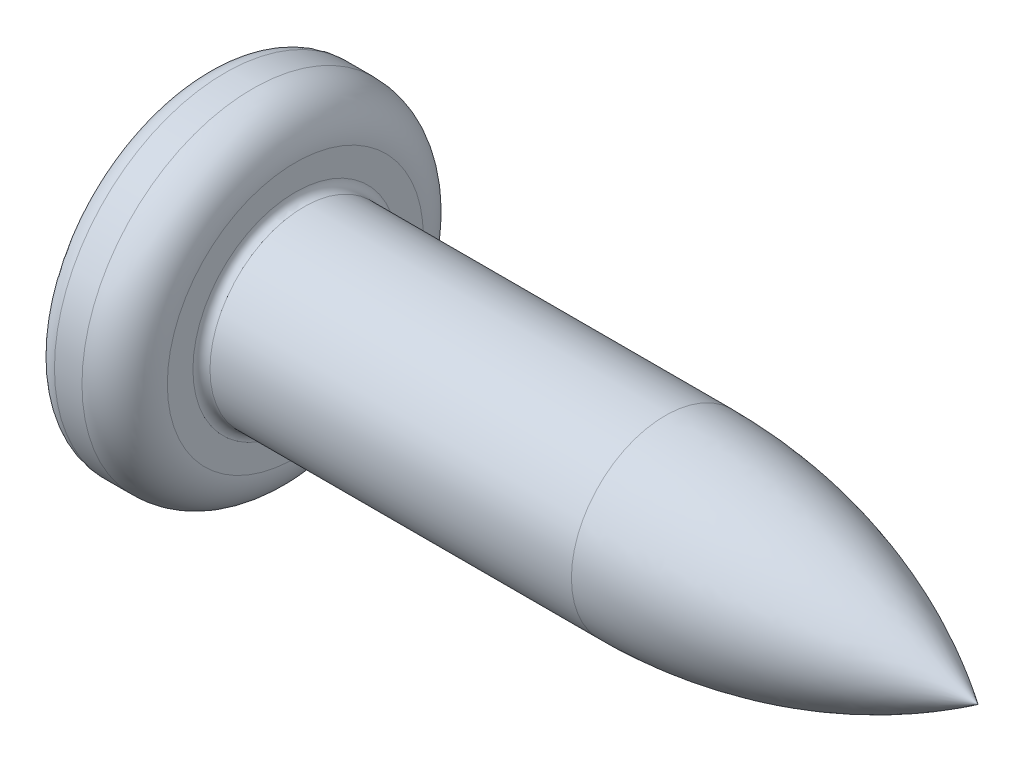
from build123d import *

# Parameters (mm, degrees)
FILLET1_R    = 0.1
RECPAT_COUNT = 2
RECPAT_ANGLE = 90


with BuildPart() as part:
    # BodySke → Base-Revolve (revolve)
    with BuildSketch(Plane.XY, mode=Mode.PRIVATE) as base_revolve_sk:
        with BuildLine():
            Line((1.5, 1.1), (1.5, 1.5))
            ThreePointArc((1.5, 1.5), (1.353553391, 1.853553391), (1, 2))
            Line((1, 2), (0.677350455, 2))
            ThreePointArc((0.677350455, 2), (0.553579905, 1.96562308), (0.465266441, 1.872340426))
            ThreePointArc((0.465266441, 1.872340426), (0.118058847, 0.964641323), (0, 0))
            Line((0, 0), (9.5, 0))
            ThreePointArc((9.5, 0), (7.748444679, 0.819069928), (5.835358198, 1.1))
            Line((5.835358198, 1.1), (1.5, 1.1))
        make_face()
    revolve(base_revolve_sk.sketch.rotate(Axis((5.835358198, 0, 0), (1, 0, 0)), 90), axis=Axis((5.835358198, 0, 0), (1, 0, 0)))

    # Fillet1
    fillet1_edges = [part.edges().sort_by_distance(p)[0] for p in [
        (1.5, 0, -1.1),
    ]]
    fillet(fillet1_edges, radius=FILLET1_R)

    # Sketch3 → Recess section 0
    with BuildSketch(Plane(origin=(0, 0, 0), x_dir=(0, 0, -1), z_dir=(1, 0, 0))):
        with BuildLine():
            Line((0.37, -1.3), (-0.37, -1.3))
            Line((-0.37, -1.3), (-0.37, 1.3))
            Line((-0.37, 1.3), (0.37, 1.3))
            Line((0.37, 1.3), (0.37, -1.3))
        make_face()
    # Sketch4 → Recess section 1
    with BuildSketch(Plane(origin=(1.5, 0, 0), x_dir=(0, 0, -1), z_dir=(1, 0, 0))):
        with BuildLine():
            Line((0.37, -0.552127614), (-0.37, -0.552127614))
            Line((-0.37, -0.552127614), (-0.37, 0.552127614))
            Line((-0.37, 0.552127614), (0.37, 0.552127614))
            Line((0.37, 0.552127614), (0.37, -0.552127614))
        make_face()
    recess = loft(mode=Mode.SUBTRACT)

    # RecPat: Recess ×2 about axis
    recpat_axis = Axis((0, 0, 0), (1, 0, 0))
    for i in range(1, RECPAT_COUNT):
        add(recess.rotate(recpat_axis, i * RECPAT_ANGLE / (RECPAT_COUNT - 1)), mode=Mode.SUBTRACT)

    # RecCorSke → RecessCore (revolve, cut)
    with BuildSketch(Plane.XY, mode=Mode.PRIVATE) as recesscore_sk:
        Polygon((0, 0), (0, 0.660890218), (1.5, 0.556), (1.680655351, 0), align=None)
    revolve(recesscore_sk.sketch.rotate(Axis((-3.175, 0, 0), (1, 0, 0)), 17.145865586), axis=Axis((-3.175, 0, 0), (1, 0, 0)), mode=Mode.SUBTRACT)


solid = part.part
